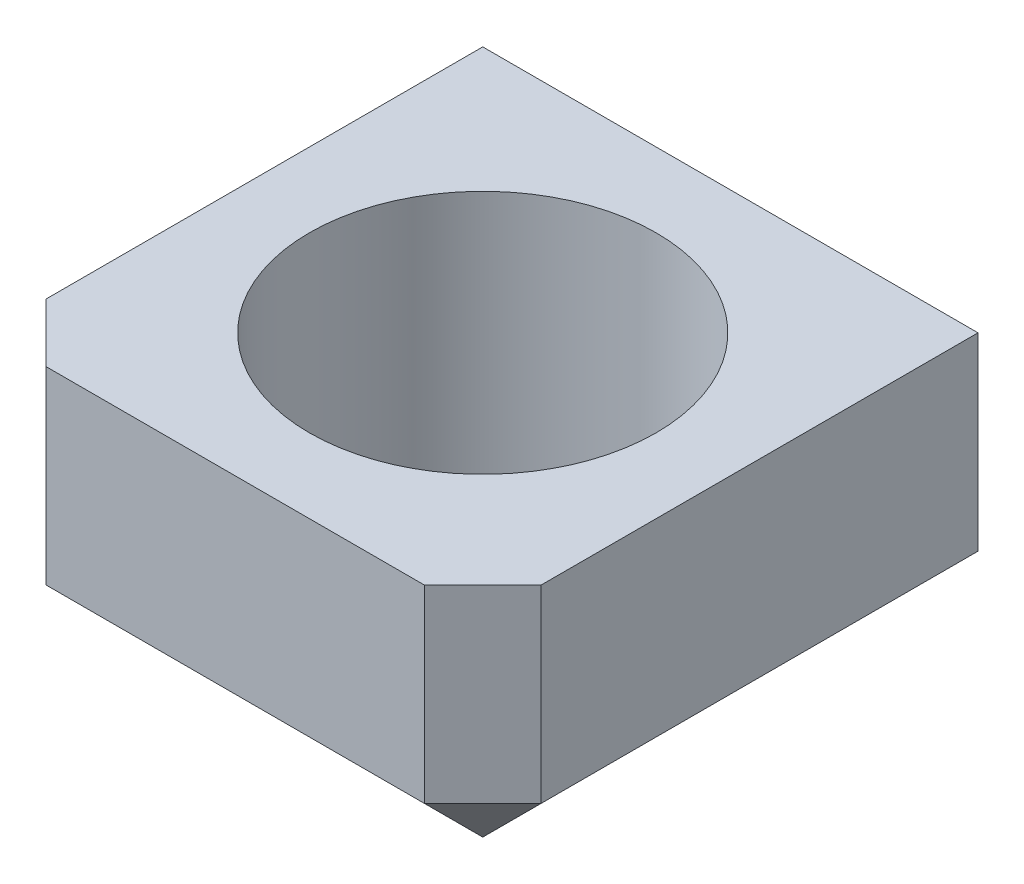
from build123d import *

# Parameters (mm, degrees)
SKETCH1_W           = 127
SKETCH1_H           = 127
SKETCH1_R           = 44.45
BOSS_EXTRUDE1_DEPTH = 63.5
CHAMFER1_SIZE       = 15


with BuildPart() as part:
    # Sketch1 → Boss-Extrude1 (new body)
    with BuildSketch(Plane(origin=(0, 0, 0), x_dir=(1, 0, 0), z_dir=(0, 1, 0))):
        Rectangle(SKETCH1_W, SKETCH1_H)
        with Locations(Location((0, 0, 0), (0, 0, 270))):
            Circle(SKETCH1_R, mode=Mode.SUBTRACT)
    extrude(amount=-BOSS_EXTRUDE1_DEPTH)

    # Chamfer1
    chamfer1_edges = [part.edges().sort_by_distance(p)[0] for p in [
        (-63.5, -63.5, 0),
        (0, -63.5, 63.5),
        (63.5, -63.5, 0),
        (63.5, -31.75, 63.5),
        (-63.5, -31.75, 63.5),
    ]]
    chamfer(chamfer1_edges, length=CHAMFER1_SIZE)


solid = part.part
